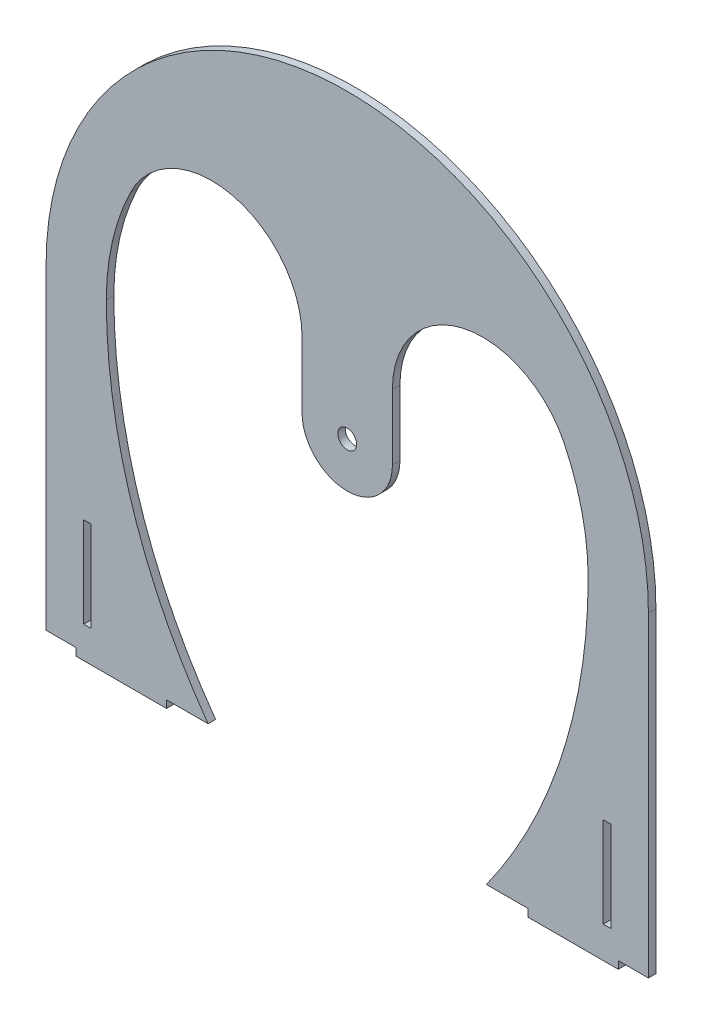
ISO-10303-21;
HEADER;
FILE_DESCRIPTION(('STEP AP214'),'2;1');
FILE_NAME('part.step','',(''),(''),'','','');
FILE_SCHEMA(('AUTOMOTIVE_DESIGN { 1 0 10303 214 1 1 1 1 }'));
ENDSEC;
DATA;
#1=APPLICATION_CONTEXT('core data for automotive mechanical design processes');
#2=APPLICATION_PROTOCOL_DEFINITION('international standard','automotive_design',2000,#1);
#3=PRODUCT_CONTEXT('',#1,'mechanical');
#4=PRODUCT('Part','Part','',(#3));
#5=PRODUCT_RELATED_PRODUCT_CATEGORY('part','',(#4));
#6=PRODUCT_DEFINITION_FORMATION('','',#4);
#7=PRODUCT_DEFINITION_CONTEXT('part definition',#1,'design');
#8=PRODUCT_DEFINITION('design','',#6,#7);
#9=PRODUCT_DEFINITION_SHAPE('','',#8);
#10=(LENGTH_UNIT() NAMED_UNIT(*) SI_UNIT(.MILLI.,.METRE.));
#11=(NAMED_UNIT(*) PLANE_ANGLE_UNIT() SI_UNIT($,.RADIAN.));
#12=(NAMED_UNIT(*) SI_UNIT($,.STERADIAN.) SOLID_ANGLE_UNIT());
#13=UNCERTAINTY_MEASURE_WITH_UNIT(LENGTH_MEASURE(1.E-05),#10,'distance_accuracy_value','');
#14=(GEOMETRIC_REPRESENTATION_CONTEXT(3) GLOBAL_UNCERTAINTY_ASSIGNED_CONTEXT((#13)) GLOBAL_UNIT_ASSIGNED_CONTEXT((#10,
#11,#12)) REPRESENTATION_CONTEXT('',''));
#15=CARTESIAN_POINT('',(0.,0.,0.));
#16=DIRECTION('',(0.,0.,1.));
#17=DIRECTION('',(1.,0.,0.));
#18=AXIS2_PLACEMENT_3D('',#15,#16,#17);
#19=CARTESIAN_POINT('',(0.,-133.35,3.175));
#20=DIRECTION('',(0.,1.,0.));
#21=DIRECTION('',(0.,0.,1.));
#22=AXIS2_PLACEMENT_3D('',#19,#20,#21);
#23=PLANE('',#22);
#24=DIRECTION('',(0.,0.,-1.));
#25=VECTOR('',#24,1.);
#26=CARTESIAN_POINT('',(76.2,-133.35,3.175));
#27=LINE('',#26,#25);
#28=CARTESIAN_POINT('',(76.2,-133.35,3.175));
#29=VERTEX_POINT('',#28);
#30=CARTESIAN_POINT('',(76.2,-133.35,0.));
#31=VERTEX_POINT('',#30);
#32=EDGE_CURVE('E57',#29,#31,#27,.T.);
#33=ORIENTED_EDGE('',*,*,#32,.F.);
#34=DIRECTION('',(1.,0.,0.));
#35=VECTOR('',#34,1.);
#36=CARTESIAN_POINT('',(0.,-133.35,3.175));
#37=LINE('',#36,#35);
#38=CARTESIAN_POINT('',(58.6764322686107,-133.35,3.175));
#39=VERTEX_POINT('',#38);
#40=EDGE_CURVE('E309',#39,#29,#37,.T.);
#41=ORIENTED_EDGE('',*,*,#40,.F.);
#42=DIRECTION('',(0.,0.,-1.));
#43=VECTOR('',#42,1.);
#44=CARTESIAN_POINT('',(58.6764322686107,-133.35,3.175));
#45=LINE('',#44,#43);
#46=CARTESIAN_POINT('',(58.6764322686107,-133.35,0.));
#47=VERTEX_POINT('',#46);
#48=EDGE_CURVE('E436',#39,#47,#45,.T.);
#49=ORIENTED_EDGE('',*,*,#48,.T.);
#50=DIRECTION('',(1.,0.,0.));
#51=VECTOR('',#50,1.);
#52=CARTESIAN_POINT('',(0.,-133.35,0.));
#53=LINE('',#52,#51);
#54=EDGE_CURVE('E365',#47,#31,#53,.T.);
#55=ORIENTED_EDGE('',*,*,#54,.T.);
#56=EDGE_LOOP('',(#33,#41,#49,#55));
#57=FACE_BOUND('',#56,.T.);
#58=ADVANCED_FACE('F34',(#57),#23,.F.);
#59=DIRECTION('',(0.,0.,1.));
#60=VECTOR('',#59,1.);
#61=CARTESIAN_POINT('',(114.3,-133.35,3.175));
#62=LINE('',#61,#60);
#63=CARTESIAN_POINT('',(114.3,-133.35,0.));
#64=VERTEX_POINT('',#63);
#65=CARTESIAN_POINT('',(114.3,-133.35,3.175));
#66=VERTEX_POINT('',#65);
#67=EDGE_CURVE('E254',#64,#66,#62,.T.);
#68=ORIENTED_EDGE('',*,*,#67,.F.);
#69=CARTESIAN_POINT('',(127.,-133.35,0.));
#70=VERTEX_POINT('',#69);
#71=EDGE_CURVE('E364',#64,#70,#53,.T.);
#72=ORIENTED_EDGE('',*,*,#71,.T.);
#73=DIRECTION('',(0.,0.,-1.));
#74=VECTOR('',#73,1.);
#75=CARTESIAN_POINT('',(127.,-133.35,3.175));
#76=LINE('',#75,#74);
#77=CARTESIAN_POINT('',(127.,-133.35,3.175));
#78=VERTEX_POINT('',#77);
#79=EDGE_CURVE('E433',#78,#70,#76,.T.);
#80=ORIENTED_EDGE('',*,*,#79,.F.);
#81=EDGE_CURVE('E49',#66,#78,#37,.T.);
#82=ORIENTED_EDGE('',*,*,#81,.F.);
#83=EDGE_LOOP('',(#68,#72,#80,#82));
#84=FACE_BOUND('',#83,.T.);
#85=ADVANCED_FACE('F512',(#84),#23,.F.);
#86=CARTESIAN_POINT('',(0.,-133.35,3.175));
#87=DIRECTION('',(0.,1.,0.));
#88=DIRECTION('',(0.,0.,1.));
#89=AXIS2_PLACEMENT_3D('',#86,#87,#88);
#90=PLANE('',#89);
#91=DIRECTION('',(0.,0.,-1.));
#92=VECTOR('',#91,1.);
#93=CARTESIAN_POINT('',(-114.3,-133.35,3.175));
#94=LINE('',#93,#92);
#95=CARTESIAN_POINT('',(-114.3,-133.35,3.175));
#96=VERTEX_POINT('',#95);
#97=CARTESIAN_POINT('',(-114.3,-133.35,0.));
#98=VERTEX_POINT('',#97);
#99=EDGE_CURVE('E257',#96,#98,#94,.T.);
#100=ORIENTED_EDGE('',*,*,#99,.F.);
#101=DIRECTION('',(1.,0.,0.));
#102=VECTOR('',#101,1.);
#103=CARTESIAN_POINT('',(0.,-133.35,3.175));
#104=LINE('',#103,#102);
#105=CARTESIAN_POINT('',(-127.,-133.35,3.175));
#106=VERTEX_POINT('',#105);
#107=EDGE_CURVE('E319',#106,#96,#104,.T.);
#108=ORIENTED_EDGE('',*,*,#107,.F.);
#109=DIRECTION('',(0.,0.,-1.));
#110=VECTOR('',#109,1.);
#111=CARTESIAN_POINT('',(-127.,-133.35,3.175));
#112=LINE('',#111,#110);
#113=CARTESIAN_POINT('',(-127.,-133.35,0.));
#114=VERTEX_POINT('',#113);
#115=EDGE_CURVE('E426',#106,#114,#112,.T.);
#116=ORIENTED_EDGE('',*,*,#115,.T.);
#117=DIRECTION('',(1.,0.,0.));
#118=VECTOR('',#117,1.);
#119=CARTESIAN_POINT('',(0.,-133.35,0.));
#120=LINE('',#119,#118);
#121=EDGE_CURVE('E376',#114,#98,#120,.T.);
#122=ORIENTED_EDGE('',*,*,#121,.T.);
#123=EDGE_LOOP('',(#100,#108,#116,#122));
#124=FACE_BOUND('',#123,.T.);
#125=ADVANCED_FACE('F529',(#124),#90,.F.);
#126=DIRECTION('',(0.,0.,1.));
#127=VECTOR('',#126,1.);
#128=CARTESIAN_POINT('',(-76.2,-133.35,3.175));
#129=LINE('',#128,#127);
#130=CARTESIAN_POINT('',(-76.2,-133.35,0.));
#131=VERTEX_POINT('',#130);
#132=CARTESIAN_POINT('',(-76.2,-133.35,3.175));
#133=VERTEX_POINT('',#132);
#134=EDGE_CURVE('E260',#131,#133,#129,.T.);
#135=ORIENTED_EDGE('',*,*,#134,.F.);
#136=CARTESIAN_POINT('',(-58.6764322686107,-133.35,0.));
#137=VERTEX_POINT('',#136);
#138=EDGE_CURVE('E375',#131,#137,#120,.T.);
#139=ORIENTED_EDGE('',*,*,#138,.T.);
#140=DIRECTION('',(0.,0.,-1.));
#141=VECTOR('',#140,1.);
#142=CARTESIAN_POINT('',(-58.6764322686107,-133.35,3.175));
#143=LINE('',#142,#141);
#144=CARTESIAN_POINT('',(-58.6764322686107,-133.35,3.175));
#145=VERTEX_POINT('',#144);
#146=EDGE_CURVE('E347',#145,#137,#143,.T.);
#147=ORIENTED_EDGE('',*,*,#146,.F.);
#148=EDGE_CURVE('E318',#133,#145,#104,.T.);
#149=ORIENTED_EDGE('',*,*,#148,.F.);
#150=EDGE_LOOP('',(#135,#139,#147,#149));
#151=FACE_BOUND('',#150,.T.);
#152=ADVANCED_FACE('F544',(#151),#90,.F.);
#153=CARTESIAN_POINT('',(3.7192471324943E-13,-85.0900000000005,3.175));
#154=DIRECTION('',(0.,1.,0.));
#155=DIRECTION('',(-1.,0.,0.));
#156=AXIS2_PLACEMENT_3D('',#153,#154,#155);
#157=PLANE('',#156);
#158=DIRECTION('',(1.,0.,0.));
#159=VECTOR('',#158,1.);
#160=CARTESIAN_POINT('',(3.7192471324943E-13,-85.0900000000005,0.));
#161=LINE('',#160,#159);
#162=CARTESIAN_POINT('',(107.95,-85.09,0.));
#163=VERTEX_POINT('',#162);
#164=CARTESIAN_POINT('',(111.125,-85.09,0.));
#165=VERTEX_POINT('',#164);
#166=EDGE_CURVE('E393',#163,#165,#161,.T.);
#167=ORIENTED_EDGE('',*,*,#166,.T.);
#168=DIRECTION('',(0.,0.,-1.));
#169=VECTOR('',#168,1.);
#170=CARTESIAN_POINT('',(111.125,-85.09,3.175));
#171=LINE('',#170,#169);
#172=CARTESIAN_POINT('',(111.125,-85.09,3.175));
#173=VERTEX_POINT('',#172);
#174=EDGE_CURVE('E411',#173,#165,#171,.T.);
#175=ORIENTED_EDGE('',*,*,#174,.F.);
#176=DIRECTION('',(1.,0.,0.));
#177=VECTOR('',#176,1.);
#178=CARTESIAN_POINT('',(3.7192471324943E-13,-85.0900000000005,3.175));
#179=LINE('',#178,#177);
#180=CARTESIAN_POINT('',(107.95,-85.09,3.175));
#181=VERTEX_POINT('',#180);
#182=EDGE_CURVE('E336',#181,#173,#179,.T.);
#183=ORIENTED_EDGE('',*,*,#182,.F.);
#184=DIRECTION('',(0.,0.,-1.));
#185=VECTOR('',#184,1.);
#186=CARTESIAN_POINT('',(107.95,-85.09,3.175));
#187=LINE('',#186,#185);
#188=EDGE_CURVE('E404',#181,#163,#187,.T.);
#189=ORIENTED_EDGE('',*,*,#188,.T.);
#190=EDGE_LOOP('',(#167,#175,#183,#189));
#191=FACE_BOUND('',#190,.T.);
#192=ADVANCED_FACE('F749',(#191),#157,.F.);
#193=CARTESIAN_POINT('',(111.125,0.,3.175));
#194=DIRECTION('',(1.,0.,0.));
#195=DIRECTION('',(0.,0.,-1.));
#196=AXIS2_PLACEMENT_3D('',#193,#194,#195);
#197=PLANE('',#196);
#198=DIRECTION('',(0.,-1.,0.));
#199=VECTOR('',#198,1.);
#200=CARTESIAN_POINT('',(111.125,0.,0.));
#201=LINE('',#200,#199);
#202=CARTESIAN_POINT('',(111.125,-123.19,0.));
#203=VERTEX_POINT('',#202);
#204=EDGE_CURVE('E396',#165,#203,#201,.T.);
#205=ORIENTED_EDGE('',*,*,#204,.T.);
#206=DIRECTION('',(0.,0.,-1.));
#207=VECTOR('',#206,1.);
#208=CARTESIAN_POINT('',(111.125,-123.19,3.175));
#209=LINE('',#208,#207);
#210=CARTESIAN_POINT('',(111.125,-123.19,3.175));
#211=VERTEX_POINT('',#210);
#212=EDGE_CURVE('E409',#211,#203,#209,.T.);
#213=ORIENTED_EDGE('',*,*,#212,.F.);
#214=DIRECTION('',(0.,-1.,0.));
#215=VECTOR('',#214,1.);
#216=CARTESIAN_POINT('',(111.125,0.,3.175));
#217=LINE('',#216,#215);
#218=EDGE_CURVE('E339',#173,#211,#217,.T.);
#219=ORIENTED_EDGE('',*,*,#218,.F.);
#220=ORIENTED_EDGE('',*,*,#174,.T.);
#221=EDGE_LOOP('',(#205,#213,#219,#220));
#222=FACE_BOUND('',#221,.T.);
#223=ADVANCED_FACE('F761',(#222),#197,.F.);
#224=CARTESIAN_POINT('',(0.,-123.19,3.175));
#225=DIRECTION('',(0.,1.,0.));
#226=DIRECTION('',(0.,0.,1.));
#227=AXIS2_PLACEMENT_3D('',#224,#225,#226);
#228=PLANE('',#227);
#229=DIRECTION('',(1.,0.,0.));
#230=VECTOR('',#229,1.);
#231=CARTESIAN_POINT('',(0.,-123.19,0.));
#232=LINE('',#231,#230);
#233=CARTESIAN_POINT('',(107.95,-123.19,0.));
#234=VERTEX_POINT('',#233);
#235=EDGE_CURVE('E399',#234,#203,#232,.T.);
#236=ORIENTED_EDGE('',*,*,#235,.F.);
#237=DIRECTION('',(0.,0.,-1.));
#238=VECTOR('',#237,1.);
#239=CARTESIAN_POINT('',(107.95,-123.19,3.175));
#240=LINE('',#239,#238);
#241=CARTESIAN_POINT('',(107.95,-123.19,3.175));
#242=VERTEX_POINT('',#241);
#243=EDGE_CURVE('E406',#242,#234,#240,.T.);
#244=ORIENTED_EDGE('',*,*,#243,.F.);
#245=DIRECTION('',(1.,0.,0.));
#246=VECTOR('',#245,1.);
#247=CARTESIAN_POINT('',(0.,-123.19,3.175));
#248=LINE('',#247,#246);
#249=EDGE_CURVE('E341',#242,#211,#248,.T.);
#250=ORIENTED_EDGE('',*,*,#249,.T.);
#251=ORIENTED_EDGE('',*,*,#212,.T.);
#252=EDGE_LOOP('',(#236,#244,#250,#251));
#253=FACE_BOUND('',#252,.T.);
#254=ADVANCED_FACE('F769',(#253),#228,.T.);
#255=CARTESIAN_POINT('',(-111.125,0.,3.175));
#256=DIRECTION('',(1.,0.,0.));
#257=DIRECTION('',(0.,0.,-1.));
#258=AXIS2_PLACEMENT_3D('',#255,#256,#257);
#259=PLANE('',#258);
#260=DIRECTION('',(0.,-1.,0.));
#261=VECTOR('',#260,1.);
#262=CARTESIAN_POINT('',(-111.125,0.,0.));
#263=LINE('',#262,#261);
#264=CARTESIAN_POINT('',(-111.125,-85.09,0.));
#265=VERTEX_POINT('',#264);
#266=CARTESIAN_POINT('',(-111.125,-123.19,0.));
#267=VERTEX_POINT('',#266);
#268=EDGE_CURVE('E378',#265,#267,#263,.T.);
#269=ORIENTED_EDGE('',*,*,#268,.F.);
#270=DIRECTION('',(0.,0.,-1.));
#271=VECTOR('',#270,1.);
#272=CARTESIAN_POINT('',(-111.125,-85.09,3.175));
#273=LINE('',#272,#271);
#274=CARTESIAN_POINT('',(-111.125,-85.09,3.175));
#275=VERTEX_POINT('',#274);
#276=EDGE_CURVE('E407',#275,#265,#273,.T.);
#277=ORIENTED_EDGE('',*,*,#276,.F.);
#278=DIRECTION('',(0.,-1.,0.));
#279=VECTOR('',#278,1.);
#280=CARTESIAN_POINT('',(-111.125,0.,3.175));
#281=LINE('',#280,#279);
#282=CARTESIAN_POINT('',(-111.125,-123.19,3.175));
#283=VERTEX_POINT('',#282);
#284=EDGE_CURVE('E322',#275,#283,#281,.T.);
#285=ORIENTED_EDGE('',*,*,#284,.T.);
#286=DIRECTION('',(0.,0.,-1.));
#287=VECTOR('',#286,1.);
#288=CARTESIAN_POINT('',(-111.125,-123.19,3.175));
#289=LINE('',#288,#287);
#290=EDGE_CURVE('E415',#283,#267,#289,.T.);
#291=ORIENTED_EDGE('',*,*,#290,.T.);
#292=EDGE_LOOP('',(#269,#277,#285,#291));
#293=FACE_BOUND('',#292,.T.);
#294=ADVANCED_FACE('F777',(#293),#259,.T.);
#295=CARTESIAN_POINT('',(-3.7192471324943E-13,-85.0900000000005,3.175));
#296=DIRECTION('',(0.,-1.,0.));
#297=DIRECTION('',(1.,0.,0.));
#298=AXIS2_PLACEMENT_3D('',#295,#296,#297);
#299=PLANE('',#298);
#300=DIRECTION('',(-1.,0.,0.));
#301=VECTOR('',#300,1.);
#302=CARTESIAN_POINT('',(-3.7192471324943E-13,-85.0900000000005,0.));
#303=LINE('',#302,#301);
#304=CARTESIAN_POINT('',(-107.95,-85.09,0.));
#305=VERTEX_POINT('',#304);
#306=EDGE_CURVE('E381',#305,#265,#303,.T.);
#307=ORIENTED_EDGE('',*,*,#306,.F.);
#308=DIRECTION('',(0.,0.,-1.));
#309=VECTOR('',#308,1.);
#310=CARTESIAN_POINT('',(-107.95,-85.09,3.175));
#311=LINE('',#310,#309);
#312=CARTESIAN_POINT('',(-107.95,-85.09,3.175));
#313=VERTEX_POINT('',#312);
#314=EDGE_CURVE('E421',#313,#305,#311,.T.);
#315=ORIENTED_EDGE('',*,*,#314,.F.);
#316=DIRECTION('',(-1.,0.,0.));
#317=VECTOR('',#316,1.);
#318=CARTESIAN_POINT('',(-3.7192471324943E-13,-85.0900000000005,3.175));
#319=LINE('',#318,#317);
#320=EDGE_CURVE('E325',#313,#275,#319,.T.);
#321=ORIENTED_EDGE('',*,*,#320,.T.);
#322=ORIENTED_EDGE('',*,*,#276,.T.);
#323=EDGE_LOOP('',(#307,#315,#321,#322));
#324=FACE_BOUND('',#323,.T.);
#325=ADVANCED_FACE('F556',(#324),#299,.T.);
#326=CARTESIAN_POINT('',(-107.95,0.,3.175));
#327=DIRECTION('',(1.,0.,0.));
#328=DIRECTION('',(0.,0.,-1.));
#329=AXIS2_PLACEMENT_3D('',#326,#327,#328);
#330=PLANE('',#329);
#331=DIRECTION('',(0.,-1.,0.));
#332=VECTOR('',#331,1.);
#333=CARTESIAN_POINT('',(-107.95,0.,0.));
#334=LINE('',#333,#332);
#335=CARTESIAN_POINT('',(-107.95,-123.19,0.));
#336=VERTEX_POINT('',#335);
#337=EDGE_CURVE('E384',#305,#336,#334,.T.);
#338=ORIENTED_EDGE('',*,*,#337,.T.);
#339=DIRECTION('',(0.,0.,-1.));
#340=VECTOR('',#339,1.);
#341=CARTESIAN_POINT('',(-107.95,-123.19,3.175));
#342=LINE('',#341,#340);
#343=CARTESIAN_POINT('',(-107.95,-123.19,3.175));
#344=VERTEX_POINT('',#343);
#345=EDGE_CURVE('E417',#344,#336,#342,.T.);
#346=ORIENTED_EDGE('',*,*,#345,.F.);
#347=DIRECTION('',(0.,-1.,0.));
#348=VECTOR('',#347,1.);
#349=CARTESIAN_POINT('',(-107.95,0.,3.175));
#350=LINE('',#349,#348);
#351=EDGE_CURVE('E328',#313,#344,#350,.T.);
#352=ORIENTED_EDGE('',*,*,#351,.F.);
#353=ORIENTED_EDGE('',*,*,#314,.T.);
#354=EDGE_LOOP('',(#338,#346,#352,#353));
#355=FACE_BOUND('',#354,.T.);
#356=ADVANCED_FACE('F549',(#355),#330,.F.);
#357=CARTESIAN_POINT('',(127.,0.,3.175));
#358=DIRECTION('',(0.,0.,-1.));
#359=DIRECTION('',(-1.,0.,0.));
#360=AXIS2_PLACEMENT_3D('',#357,#358,#359);
#361=CYLINDRICAL_SURFACE('',#360,228.6);
#362=CARTESIAN_POINT('',(127.,0.,0.));
#363=DIRECTION('',(0.,0.,1.));
#364=DIRECTION('',(1.,0.,0.));
#365=AXIS2_PLACEMENT_3D('',#362,#363,#364);
#366=CIRCLE('',#365,228.6);
#367=CARTESIAN_POINT('',(-101.6,0.,0.));
#368=VERTEX_POINT('',#367);
#369=EDGE_CURVE('E289',#368,#137,#366,.T.);
#370=ORIENTED_EDGE('',*,*,#369,.F.);
#371=DIRECTION('',(0.,0.,-1.));
#372=VECTOR('',#371,1.);
#373=CARTESIAN_POINT('',(-101.6,0.,3.175));
#374=LINE('',#373,#372);
#375=CARTESIAN_POINT('',(-101.6,0.,3.175));
#376=VERTEX_POINT('',#375);
#377=EDGE_CURVE('E418',#376,#368,#374,.T.);
#378=ORIENTED_EDGE('',*,*,#377,.F.);
#379=CARTESIAN_POINT('',(127.,0.,3.175));
#380=DIRECTION('',(0.,0.,1.));
#381=DIRECTION('',(1.,0.,0.));
#382=AXIS2_PLACEMENT_3D('',#379,#380,#381);
#383=CIRCLE('',#382,228.6);
#384=EDGE_CURVE('E290',#376,#145,#383,.T.);
#385=ORIENTED_EDGE('',*,*,#384,.T.);
#386=ORIENTED_EDGE('',*,*,#146,.T.);
#387=EDGE_LOOP('',(#370,#378,#385,#386));
#388=FACE_BOUND('',#387,.T.);
#389=ADVANCED_FACE('F547',(#388),#361,.F.);
#390=CARTESIAN_POINT('',(0.,0.,3.175));
#391=DIRECTION('',(0.,0.,-1.));
#392=DIRECTION('',(-1.,0.,0.));
#393=AXIS2_PLACEMENT_3D('',#390,#391,#392);
#394=CYLINDRICAL_SURFACE('',#393,101.6);
#395=CARTESIAN_POINT('',(0.,0.,0.));
#396=DIRECTION('',(0.,0.,1.));
#397=DIRECTION('',(1.,0.,0.));
#398=AXIS2_PLACEMENT_3D('',#395,#396,#397);
#399=CIRCLE('',#398,101.6);
#400=CARTESIAN_POINT('',(-91.44,44.2864132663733,0.));
#401=VERTEX_POINT('',#400);
#402=EDGE_CURVE('E349',#401,#368,#399,.T.);
#403=ORIENTED_EDGE('',*,*,#402,.F.);
#404=DIRECTION('',(0.,0.,-1.));
#405=VECTOR('',#404,1.);
#406=CARTESIAN_POINT('',(-91.44,44.2864132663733,3.175));
#407=LINE('',#406,#405);
#408=CARTESIAN_POINT('',(-91.44,44.2864132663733,3.175));
#409=VERTEX_POINT('',#408);
#410=EDGE_CURVE('E455',#401,#409,#407,.F.);
#411=ORIENTED_EDGE('',*,*,#410,.T.);
#412=CARTESIAN_POINT('',(0.,0.,3.175));
#413=DIRECTION('',(0.,0.,1.));
#414=DIRECTION('',(1.,0.,0.));
#415=AXIS2_PLACEMENT_3D('',#412,#413,#414);
#416=CIRCLE('',#415,101.6);
#417=EDGE_CURVE('E293',#409,#376,#416,.T.);
#418=ORIENTED_EDGE('',*,*,#417,.T.);
#419=ORIENTED_EDGE('',*,*,#377,.T.);
#420=EDGE_LOOP('',(#403,#411,#418,#419));
#421=FACE_BOUND('',#420,.T.);
#422=ADVANCED_FACE('F467',(#421),#394,.F.);
#423=CARTESIAN_POINT('',(-19.05,0.,3.175));
#424=DIRECTION('',(-1.,0.,0.));
#425=DIRECTION('',(0.,0.,1.));
#426=AXIS2_PLACEMENT_3D('',#423,#424,#425);
#427=PLANE('',#426);
#428=DIRECTION('',(0.,1.,0.));
#429=VECTOR('',#428,1.);
#430=CARTESIAN_POINT('',(-19.05,0.,3.175));
#431=LINE('',#430,#429);
#432=CARTESIAN_POINT('',(-19.05,0.,3.175));
#433=VERTEX_POINT('',#432);
#434=CARTESIAN_POINT('',(-19.05,27.6790082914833,3.175));
#435=VERTEX_POINT('',#434);
#436=EDGE_CURVE('E296',#433,#435,#431,.T.);
#437=ORIENTED_EDGE('',*,*,#436,.T.);
#438=DIRECTION('',(0.,0.,1.));
#439=VECTOR('',#438,1.);
#440=CARTESIAN_POINT('',(-19.05,27.6790082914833,0.));
#441=LINE('',#440,#439);
#442=CARTESIAN_POINT('',(-19.05,27.6790082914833,0.));
#443=VERTEX_POINT('',#442);
#444=EDGE_CURVE('E452',#435,#443,#441,.F.);
#445=ORIENTED_EDGE('',*,*,#444,.T.);
#446=DIRECTION('',(0.,1.,0.));
#447=VECTOR('',#446,1.);
#448=CARTESIAN_POINT('',(-19.05,0.,0.));
#449=LINE('',#448,#447);
#450=CARTESIAN_POINT('',(-19.05,0.,0.));
#451=VERTEX_POINT('',#450);
#452=EDGE_CURVE('E351',#451,#443,#449,.T.);
#453=ORIENTED_EDGE('',*,*,#452,.F.);
#454=DIRECTION('',(0.,0.,-1.));
#455=VECTOR('',#454,1.);
#456=CARTESIAN_POINT('',(-19.05,0.,3.175));
#457=LINE('',#456,#455);
#458=EDGE_CURVE('E444',#433,#451,#457,.T.);
#459=ORIENTED_EDGE('',*,*,#458,.F.);
#460=EDGE_LOOP('',(#437,#445,#453,#459));
#461=FACE_BOUND('',#460,.T.);
#462=ADVANCED_FACE('F478',(#461),#427,.T.);
#463=CARTESIAN_POINT('',(0.,0.,3.175));
#464=DIRECTION('',(0.,0.,-1.));
#465=DIRECTION('',(-1.,0.,0.));
#466=AXIS2_PLACEMENT_3D('',#463,#464,#465);
#467=CYLINDRICAL_SURFACE('',#466,19.05);
#468=CARTESIAN_POINT('',(0.,0.,0.));
#469=DIRECTION('',(0.,0.,1.));
#470=DIRECTION('',(1.,0.,0.));
#471=AXIS2_PLACEMENT_3D('',#468,#469,#470);
#472=CIRCLE('',#471,19.05);
#473=CARTESIAN_POINT('',(19.05,0.,0.));
#474=VERTEX_POINT('',#473);
#475=EDGE_CURVE('E354',#451,#474,#472,.T.);
#476=ORIENTED_EDGE('',*,*,#475,.T.);
#477=DIRECTION('',(0.,0.,-1.));
#478=VECTOR('',#477,1.);
#479=CARTESIAN_POINT('',(19.05,0.,3.175));
#480=LINE('',#479,#478);
#481=CARTESIAN_POINT('',(19.05,0.,3.175));
#482=VERTEX_POINT('',#481);
#483=EDGE_CURVE('E441',#482,#474,#480,.T.);
#484=ORIENTED_EDGE('',*,*,#483,.F.);
#485=CARTESIAN_POINT('',(0.,0.,3.175));
#486=DIRECTION('',(0.,0.,1.));
#487=DIRECTION('',(1.,0.,0.));
#488=AXIS2_PLACEMENT_3D('',#485,#486,#487);
#489=CIRCLE('',#488,19.05);
#490=EDGE_CURVE('E299',#433,#482,#489,.T.);
#491=ORIENTED_EDGE('',*,*,#490,.F.);
#492=ORIENTED_EDGE('',*,*,#458,.T.);
#493=EDGE_LOOP('',(#476,#484,#491,#492));
#494=FACE_BOUND('',#493,.T.);
#495=ADVANCED_FACE('F482',(#494),#467,.T.);
#496=CARTESIAN_POINT('',(19.05,0.,3.175));
#497=DIRECTION('',(-1.,0.,0.));
#498=DIRECTION('',(0.,0.,1.));
#499=AXIS2_PLACEMENT_3D('',#496,#497,#498);
#500=PLANE('',#499);
#501=DIRECTION('',(0.,1.,0.));
#502=VECTOR('',#501,1.);
#503=CARTESIAN_POINT('',(19.05,0.,0.));
#504=LINE('',#503,#502);
#505=CARTESIAN_POINT('',(19.05,27.6790082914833,0.));
#506=VERTEX_POINT('',#505);
#507=EDGE_CURVE('E356',#474,#506,#504,.T.);
#508=ORIENTED_EDGE('',*,*,#507,.T.);
#509=DIRECTION('',(0.,0.,-1.));
#510=VECTOR('',#509,1.);
#511=CARTESIAN_POINT('',(19.05,27.6790082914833,3.175));
#512=LINE('',#511,#510);
#513=CARTESIAN_POINT('',(19.05,27.6790082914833,3.175));
#514=VERTEX_POINT('',#513);
#515=EDGE_CURVE('E450',#506,#514,#512,.F.);
#516=ORIENTED_EDGE('',*,*,#515,.T.);
#517=DIRECTION('',(0.,1.,0.));
#518=VECTOR('',#517,1.);
#519=CARTESIAN_POINT('',(19.05,0.,3.175));
#520=LINE('',#519,#518);
#521=EDGE_CURVE('E301',#482,#514,#520,.T.);
#522=ORIENTED_EDGE('',*,*,#521,.F.);
#523=ORIENTED_EDGE('',*,*,#483,.T.);
#524=EDGE_LOOP('',(#508,#516,#522,#523));
#525=FACE_BOUND('',#524,.T.);
#526=ADVANCED_FACE('F571',(#525),#500,.F.);
#527=CARTESIAN_POINT('',(0.,0.,3.175));
#528=DIRECTION('',(0.,0.,-1.));
#529=DIRECTION('',(-1.,0.,0.));
#530=AXIS2_PLACEMENT_3D('',#527,#528,#529);
#531=CYLINDRICAL_SURFACE('',#530,101.6);
#532=CARTESIAN_POINT('',(0.,0.,3.175));
#533=DIRECTION('',(0.,0.,1.));
#534=DIRECTION('',(1.,0.,0.));
#535=AXIS2_PLACEMENT_3D('',#532,#533,#534);
#536=CIRCLE('',#535,101.6);
#537=CARTESIAN_POINT('',(101.6,0.,3.175));
#538=VERTEX_POINT('',#537);
#539=CARTESIAN_POINT('',(91.44,44.2864132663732,3.175));
#540=VERTEX_POINT('',#539);
#541=EDGE_CURVE('E304',#538,#540,#536,.T.);
#542=ORIENTED_EDGE('',*,*,#541,.T.);
#543=DIRECTION('',(0.,0.,-1.));
#544=VECTOR('',#543,1.);
#545=CARTESIAN_POINT('',(91.44,44.2864132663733,3.175));
#546=LINE('',#545,#544);
#547=CARTESIAN_POINT('',(91.44,44.2864132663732,0.));
#548=VERTEX_POINT('',#547);
#549=EDGE_CURVE('E414',#540,#548,#546,.T.);
#550=ORIENTED_EDGE('',*,*,#549,.T.);
#551=CARTESIAN_POINT('',(0.,0.,0.));
#552=DIRECTION('',(0.,0.,1.));
#553=DIRECTION('',(1.,0.,0.));
#554=AXIS2_PLACEMENT_3D('',#551,#552,#553);
#555=CIRCLE('',#554,101.6);
#556=CARTESIAN_POINT('',(101.6,0.,0.));
#557=VERTEX_POINT('',#556);
#558=EDGE_CURVE('E359',#557,#548,#555,.T.);
#559=ORIENTED_EDGE('',*,*,#558,.F.);
#560=DIRECTION('',(0.,0.,-1.));
#561=VECTOR('',#560,1.);
#562=CARTESIAN_POINT('',(101.6,0.,3.175));
#563=LINE('',#562,#561);
#564=EDGE_CURVE('E439',#538,#557,#563,.T.);
#565=ORIENTED_EDGE('',*,*,#564,.F.);
#566=EDGE_LOOP('',(#542,#550,#559,#565));
#567=FACE_BOUND('',#566,.T.);
#568=ADVANCED_FACE('F493',(#567),#531,.F.);
#569=CARTESIAN_POINT('',(-127.,0.,3.175));
#570=DIRECTION('',(0.,0.,-1.));
#571=DIRECTION('',(-1.,0.,0.));
#572=AXIS2_PLACEMENT_3D('',#569,#570,#571);
#573=CYLINDRICAL_SURFACE('',#572,228.6);
#574=CARTESIAN_POINT('',(-127.,0.,0.));
#575=DIRECTION('',(0.,0.,1.));
#576=DIRECTION('',(1.,0.,0.));
#577=AXIS2_PLACEMENT_3D('',#574,#575,#576);
#578=CIRCLE('',#577,228.6);
#579=EDGE_CURVE('E362',#557,#47,#578,.F.);
#580=ORIENTED_EDGE('',*,*,#579,.T.);
#581=ORIENTED_EDGE('',*,*,#48,.F.);
#582=CARTESIAN_POINT('',(-127.,0.,3.175));
#583=DIRECTION('',(0.,0.,1.));
#584=DIRECTION('',(1.,0.,0.));
#585=AXIS2_PLACEMENT_3D('',#582,#583,#584);
#586=CIRCLE('',#585,228.6);
#587=EDGE_CURVE('E307',#538,#39,#586,.F.);
#588=ORIENTED_EDGE('',*,*,#587,.F.);
#589=ORIENTED_EDGE('',*,*,#564,.T.);
#590=EDGE_LOOP('',(#580,#581,#588,#589));
#591=FACE_BOUND('',#590,.T.);
#592=ADVANCED_FACE('F498',(#591),#573,.F.);
#593=CARTESIAN_POINT('',(127.,0.,3.175));
#594=DIRECTION('',(-1.,0.,0.));
#595=DIRECTION('',(0.,0.,1.));
#596=AXIS2_PLACEMENT_3D('',#593,#594,#595);
#597=PLANE('',#596);
#598=DIRECTION('',(0.,1.,0.));
#599=VECTOR('',#598,1.);
#600=CARTESIAN_POINT('',(127.,0.,0.));
#601=LINE('',#600,#599);
#602=CARTESIAN_POINT('',(127.,0.,0.));
#603=VERTEX_POINT('',#602);
#604=EDGE_CURVE('E367',#70,#603,#601,.T.);
#605=ORIENTED_EDGE('',*,*,#604,.T.);
#606=DIRECTION('',(0.,0.,-1.));
#607=VECTOR('',#606,1.);
#608=CARTESIAN_POINT('',(127.,0.,3.175));
#609=LINE('',#608,#607);
#610=CARTESIAN_POINT('',(127.,0.,3.175));
#611=VERTEX_POINT('',#610);
#612=EDGE_CURVE('E430',#611,#603,#609,.T.);
#613=ORIENTED_EDGE('',*,*,#612,.F.);
#614=DIRECTION('',(0.,1.,0.));
#615=VECTOR('',#614,1.);
#616=CARTESIAN_POINT('',(127.,0.,3.175));
#617=LINE('',#616,#615);
#618=EDGE_CURVE('E311',#78,#611,#617,.T.);
#619=ORIENTED_EDGE('',*,*,#618,.F.);
#620=ORIENTED_EDGE('',*,*,#79,.T.);
#621=EDGE_LOOP('',(#605,#613,#619,#620));
#622=FACE_BOUND('',#621,.T.);
#623=ADVANCED_FACE('F515',(#622),#597,.F.);
#624=CARTESIAN_POINT('',(0.,0.,3.175));
#625=DIRECTION('',(0.,0.,-1.));
#626=DIRECTION('',(-1.,0.,0.));
#627=AXIS2_PLACEMENT_3D('',#624,#625,#626);
#628=CYLINDRICAL_SURFACE('',#627,127.);
#629=CARTESIAN_POINT('',(0.,0.,0.));
#630=DIRECTION('',(0.,0.,1.));
#631=DIRECTION('',(1.,0.,0.));
#632=AXIS2_PLACEMENT_3D('',#629,#630,#631);
#633=CIRCLE('',#632,127.);
#634=CARTESIAN_POINT('',(-127.,0.,0.));
#635=VERTEX_POINT('',#634);
#636=EDGE_CURVE('E369',#603,#635,#633,.T.);
#637=ORIENTED_EDGE('',*,*,#636,.T.);
#638=DIRECTION('',(0.,0.,-1.));
#639=VECTOR('',#638,1.);
#640=CARTESIAN_POINT('',(-127.,0.,3.175));
#641=LINE('',#640,#639);
#642=CARTESIAN_POINT('',(-127.,0.,3.175));
#643=VERTEX_POINT('',#642);
#644=EDGE_CURVE('E428',#643,#635,#641,.T.);
#645=ORIENTED_EDGE('',*,*,#644,.F.);
#646=CARTESIAN_POINT('',(0.,0.,3.175));
#647=DIRECTION('',(0.,0.,1.));
#648=DIRECTION('',(1.,0.,0.));
#649=AXIS2_PLACEMENT_3D('',#646,#647,#648);
#650=CIRCLE('',#649,127.);
#651=EDGE_CURVE('E313',#611,#643,#650,.T.);
#652=ORIENTED_EDGE('',*,*,#651,.F.);
#653=ORIENTED_EDGE('',*,*,#612,.T.);
#654=EDGE_LOOP('',(#637,#645,#652,#653));
#655=FACE_BOUND('',#654,.T.);
#656=ADVANCED_FACE('F520',(#655),#628,.T.);
#657=CARTESIAN_POINT('',(-127.,0.,3.175));
#658=DIRECTION('',(-1.,0.,0.));
#659=DIRECTION('',(0.,0.,1.));
#660=AXIS2_PLACEMENT_3D('',#657,#658,#659);
#661=PLANE('',#660);
#662=DIRECTION('',(0.,1.,0.));
#663=VECTOR('',#662,1.);
#664=CARTESIAN_POINT('',(-127.,0.,0.));
#665=LINE('',#664,#663);
#666=EDGE_CURVE('E372',#114,#635,#665,.T.);
#667=ORIENTED_EDGE('',*,*,#666,.F.);
#668=ORIENTED_EDGE('',*,*,#115,.F.);
#669=DIRECTION('',(0.,1.,0.));
#670=VECTOR('',#669,1.);
#671=CARTESIAN_POINT('',(-127.,0.,3.175));
#672=LINE('',#671,#670);
#673=EDGE_CURVE('E315',#106,#643,#672,.T.);
#674=ORIENTED_EDGE('',*,*,#673,.T.);
#675=ORIENTED_EDGE('',*,*,#644,.T.);
#676=EDGE_LOOP('',(#667,#668,#674,#675));
#677=FACE_BOUND('',#676,.T.);
#678=ADVANCED_FACE('F526',(#677),#661,.T.);
#679=CARTESIAN_POINT('',(0.,0.,3.175));
#680=DIRECTION('',(0.,0.,-1.));
#681=DIRECTION('',(-1.,0.,0.));
#682=AXIS2_PLACEMENT_3D('',#679,#680,#681);
#683=CYLINDRICAL_SURFACE('',#682,3.96875);
#684=CARTESIAN_POINT('',(0.,0.,3.175));
#685=DIRECTION('',(0.,0.,1.));
#686=DIRECTION('',(1.,0.,0.));
#687=AXIS2_PLACEMENT_3D('',#684,#685,#686);
#688=CIRCLE('',#687,3.96875);
#689=CARTESIAN_POINT('',(3.96875,0.,3.175));
#690=VERTEX_POINT('',#689);
#691=EDGE_CURVE('E333',#690,#690,#688,.T.);
#692=ORIENTED_EDGE('',*,*,#691,.T.);
#693=EDGE_LOOP('',(#692));
#694=FACE_BOUND('',#693,.T.);
#695=CARTESIAN_POINT('',(0.,0.,0.));
#696=DIRECTION('',(0.,0.,1.));
#697=DIRECTION('',(1.,0.,0.));
#698=AXIS2_PLACEMENT_3D('',#695,#696,#697);
#699=CIRCLE('',#698,3.96875);
#700=CARTESIAN_POINT('',(3.96875,0.,0.));
#701=VERTEX_POINT('',#700);
#702=EDGE_CURVE('E390',#701,#701,#699,.T.);
#703=ORIENTED_EDGE('',*,*,#702,.F.);
#704=EDGE_LOOP('',(#703));
#705=FACE_BOUND('',#704,.T.);
#706=ADVANCED_FACE('F614',(#694,#705),#683,.F.);
#707=CARTESIAN_POINT('',(0.,-123.19,3.175));
#708=DIRECTION('',(0.,-1.,0.));
#709=DIRECTION('',(0.,0.,-1.));
#710=AXIS2_PLACEMENT_3D('',#707,#708,#709);
#711=PLANE('',#710);
#712=DIRECTION('',(-1.,0.,0.));
#713=VECTOR('',#712,1.);
#714=CARTESIAN_POINT('',(0.,-123.19,0.));
#715=LINE('',#714,#713);
#716=EDGE_CURVE('E387',#336,#267,#715,.T.);
#717=ORIENTED_EDGE('',*,*,#716,.T.);
#718=ORIENTED_EDGE('',*,*,#290,.F.);
#719=DIRECTION('',(-1.,0.,0.));
#720=VECTOR('',#719,1.);
#721=CARTESIAN_POINT('',(0.,-123.19,3.175));
#722=LINE('',#721,#720);
#723=EDGE_CURVE('E331',#344,#283,#722,.T.);
#724=ORIENTED_EDGE('',*,*,#723,.F.);
#725=ORIENTED_EDGE('',*,*,#345,.T.);
#726=EDGE_LOOP('',(#717,#718,#724,#725));
#727=FACE_BOUND('',#726,.T.);
#728=ADVANCED_FACE('F621',(#727),#711,.F.);
#729=CARTESIAN_POINT('',(107.95,0.,3.175));
#730=DIRECTION('',(1.,0.,0.));
#731=DIRECTION('',(0.,0.,-1.));
#732=AXIS2_PLACEMENT_3D('',#729,#730,#731);
#733=PLANE('',#732);
#734=DIRECTION('',(0.,-1.,0.));
#735=VECTOR('',#734,1.);
#736=CARTESIAN_POINT('',(107.95,0.,0.));
#737=LINE('',#736,#735);
#738=EDGE_CURVE('E294',#163,#234,#737,.T.);
#739=ORIENTED_EDGE('',*,*,#738,.F.);
#740=ORIENTED_EDGE('',*,*,#188,.F.);
#741=DIRECTION('',(0.,-1.,0.));
#742=VECTOR('',#741,1.);
#743=CARTESIAN_POINT('',(107.95,0.,3.175));
#744=LINE('',#743,#742);
#745=EDGE_CURVE('E344',#181,#242,#744,.T.);
#746=ORIENTED_EDGE('',*,*,#745,.T.);
#747=ORIENTED_EDGE('',*,*,#243,.T.);
#748=EDGE_LOOP('',(#739,#740,#746,#747));
#749=FACE_BOUND('',#748,.T.);
#750=ADVANCED_FACE('F629',(#749),#733,.T.);
#751=CARTESIAN_POINT('',(0.,0.,3.175));
#752=DIRECTION('',(0.,0.,1.));
#753=DIRECTION('',(1.,0.,0.));
#754=AXIS2_PLACEMENT_3D('',#751,#752,#753);
#755=PLANE('',#754);
#756=ORIENTED_EDGE('',*,*,#384,.F.);
#757=ORIENTED_EDGE('',*,*,#417,.F.);
#758=CARTESIAN_POINT('',(-57.15,27.6790082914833,3.175));
#759=DIRECTION('',(0.,0.,1.));
#760=DIRECTION('',(1.,0.,0.));
#761=AXIS2_PLACEMENT_3D('',#758,#759,#760);
#762=CIRCLE('',#761,38.1);
#763=EDGE_CURVE('E11',#409,#435,#762,.F.);
#764=ORIENTED_EDGE('',*,*,#763,.T.);
#765=ORIENTED_EDGE('',*,*,#436,.F.);
#766=ORIENTED_EDGE('',*,*,#490,.T.);
#767=ORIENTED_EDGE('',*,*,#521,.T.);
#768=CARTESIAN_POINT('',(57.15,27.6790082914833,3.175));
#769=DIRECTION('',(0.,0.,1.));
#770=DIRECTION('',(1.,0.,0.));
#771=AXIS2_PLACEMENT_3D('',#768,#769,#770);
#772=CIRCLE('',#771,38.1);
#773=EDGE_CURVE('E459',#514,#540,#772,.F.);
#774=ORIENTED_EDGE('',*,*,#773,.T.);
#775=ORIENTED_EDGE('',*,*,#541,.F.);
#776=ORIENTED_EDGE('',*,*,#587,.T.);
#777=ORIENTED_EDGE('',*,*,#40,.T.);
#778=DIRECTION('',(0.,1.,0.));
#779=VECTOR('',#778,1.);
#780=CARTESIAN_POINT('',(76.2,-136.525,3.175));
#781=LINE('',#780,#779);
#782=CARTESIAN_POINT('',(76.2,-136.525,3.175));
#783=VERTEX_POINT('',#782);
#784=EDGE_CURVE('E500',#783,#29,#781,.T.);
#785=ORIENTED_EDGE('',*,*,#784,.F.);
#786=DIRECTION('',(-1.,0.,0.));
#787=VECTOR('',#786,1.);
#788=CARTESIAN_POINT('',(76.2,-136.525,3.175));
#789=LINE('',#788,#787);
#790=CARTESIAN_POINT('',(114.3,-136.525,3.175));
#791=VERTEX_POINT('',#790);
#792=EDGE_CURVE('E250',#791,#783,#789,.T.);
#793=ORIENTED_EDGE('',*,*,#792,.F.);
#794=DIRECTION('',(0.,1.,0.));
#795=VECTOR('',#794,1.);
#796=CARTESIAN_POINT('',(114.3,-136.525,3.175));
#797=LINE('',#796,#795);
#798=EDGE_CURVE('E262',#791,#66,#797,.T.);
#799=ORIENTED_EDGE('',*,*,#798,.T.);
#800=ORIENTED_EDGE('',*,*,#81,.T.);
#801=ORIENTED_EDGE('',*,*,#618,.T.);
#802=ORIENTED_EDGE('',*,*,#651,.T.);
#803=ORIENTED_EDGE('',*,*,#673,.F.);
#804=ORIENTED_EDGE('',*,*,#107,.T.);
#805=DIRECTION('',(0.,1.,0.));
#806=VECTOR('',#805,1.);
#807=CARTESIAN_POINT('',(-114.3,-136.525,3.175));
#808=LINE('',#807,#806);
#809=CARTESIAN_POINT('',(-114.3,-136.525,3.175));
#810=VERTEX_POINT('',#809);
#811=EDGE_CURVE('E274',#810,#96,#808,.T.);
#812=ORIENTED_EDGE('',*,*,#811,.F.);
#813=DIRECTION('',(-1.,0.,0.));
#814=VECTOR('',#813,1.);
#815=CARTESIAN_POINT('',(-114.3,-136.525,3.175));
#816=LINE('',#815,#814);
#817=CARTESIAN_POINT('',(-76.2,-136.525,3.175));
#818=VERTEX_POINT('',#817);
#819=EDGE_CURVE('E273',#818,#810,#816,.T.);
#820=ORIENTED_EDGE('',*,*,#819,.F.);
#821=DIRECTION('',(0.,1.,0.));
#822=VECTOR('',#821,1.);
#823=CARTESIAN_POINT('',(-76.2,-136.525,3.175));
#824=LINE('',#823,#822);
#825=EDGE_CURVE('E280',#818,#133,#824,.T.);
#826=ORIENTED_EDGE('',*,*,#825,.T.);
#827=ORIENTED_EDGE('',*,*,#148,.T.);
#828=EDGE_LOOP('',(#756,#757,#764,#765,#766,#767,#774,#775,#776,#777,#785,#793,#799,#800,#801,
#802,#803,#804,#812,#820,#826,#827));
#829=FACE_BOUND('',#828,.T.);
#830=ORIENTED_EDGE('',*,*,#284,.F.);
#831=ORIENTED_EDGE('',*,*,#320,.F.);
#832=ORIENTED_EDGE('',*,*,#351,.T.);
#833=ORIENTED_EDGE('',*,*,#723,.T.);
#834=EDGE_LOOP('',(#830,#831,#832,#833));
#835=FACE_BOUND('',#834,.T.);
#836=ORIENTED_EDGE('',*,*,#691,.F.);
#837=EDGE_LOOP('',(#836));
#838=FACE_BOUND('',#837,.T.);
#839=ORIENTED_EDGE('',*,*,#182,.T.);
#840=ORIENTED_EDGE('',*,*,#218,.T.);
#841=ORIENTED_EDGE('',*,*,#249,.F.);
#842=ORIENTED_EDGE('',*,*,#745,.F.);
#843=EDGE_LOOP('',(#839,#840,#841,#842));
#844=FACE_BOUND('',#843,.T.);
#845=ADVANCED_FACE('F475',(#829,#835,#838,#844),#755,.T.);
#846=CARTESIAN_POINT('',(0.,0.,0.));
#847=DIRECTION('',(0.,0.,1.));
#848=DIRECTION('',(1.,0.,0.));
#849=AXIS2_PLACEMENT_3D('',#846,#847,#848);
#850=PLANE('',#849);
#851=ORIENTED_EDGE('',*,*,#369,.T.);
#852=ORIENTED_EDGE('',*,*,#138,.F.);
#853=DIRECTION('',(0.,1.,0.));
#854=VECTOR('',#853,1.);
#855=CARTESIAN_POINT('',(-76.2,-136.525,0.));
#856=LINE('',#855,#854);
#857=CARTESIAN_POINT('',(-76.2,-136.525,0.));
#858=VERTEX_POINT('',#857);
#859=EDGE_CURVE('E283',#858,#131,#856,.T.);
#860=ORIENTED_EDGE('',*,*,#859,.F.);
#861=DIRECTION('',(1.,0.,0.));
#862=VECTOR('',#861,1.);
#863=CARTESIAN_POINT('',(-114.3,-136.525,0.));
#864=LINE('',#863,#862);
#865=CARTESIAN_POINT('',(-114.3,-136.525,0.));
#866=VERTEX_POINT('',#865);
#867=EDGE_CURVE('E269',#866,#858,#864,.T.);
#868=ORIENTED_EDGE('',*,*,#867,.F.);
#869=DIRECTION('',(0.,1.,0.));
#870=VECTOR('',#869,1.);
#871=CARTESIAN_POINT('',(-114.3,-136.525,0.));
#872=LINE('',#871,#870);
#873=EDGE_CURVE('E286',#866,#98,#872,.T.);
#874=ORIENTED_EDGE('',*,*,#873,.T.);
#875=ORIENTED_EDGE('',*,*,#121,.F.);
#876=ORIENTED_EDGE('',*,*,#666,.T.);
#877=ORIENTED_EDGE('',*,*,#636,.F.);
#878=ORIENTED_EDGE('',*,*,#604,.F.);
#879=ORIENTED_EDGE('',*,*,#71,.F.);
#880=DIRECTION('',(0.,1.,0.));
#881=VECTOR('',#880,1.);
#882=CARTESIAN_POINT('',(114.3,-136.525,0.));
#883=LINE('',#882,#881);
#884=CARTESIAN_POINT('',(114.3,-136.525,0.));
#885=VERTEX_POINT('',#884);
#886=EDGE_CURVE('E241',#885,#64,#883,.T.);
#887=ORIENTED_EDGE('',*,*,#886,.F.);
#888=DIRECTION('',(1.,0.,0.));
#889=VECTOR('',#888,1.);
#890=CARTESIAN_POINT('',(76.2,-136.525,0.));
#891=LINE('',#890,#889);
#892=CARTESIAN_POINT('',(76.2,-136.525,0.));
#893=VERTEX_POINT('',#892);
#894=EDGE_CURVE('E232',#893,#885,#891,.T.);
#895=ORIENTED_EDGE('',*,*,#894,.F.);
#896=DIRECTION('',(0.,1.,0.));
#897=VECTOR('',#896,1.);
#898=CARTESIAN_POINT('',(76.2,-136.525,0.));
#899=LINE('',#898,#897);
#900=EDGE_CURVE('E239',#893,#31,#899,.T.);
#901=ORIENTED_EDGE('',*,*,#900,.T.);
#902=ORIENTED_EDGE('',*,*,#54,.F.);
#903=ORIENTED_EDGE('',*,*,#579,.F.);
#904=ORIENTED_EDGE('',*,*,#558,.T.);
#905=CARTESIAN_POINT('',(57.15,27.6790082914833,0.));
#906=DIRECTION('',(0.,0.,1.));
#907=DIRECTION('',(1.,0.,0.));
#908=AXIS2_PLACEMENT_3D('',#905,#906,#907);
#909=CIRCLE('',#908,38.1);
#910=EDGE_CURVE('E457',#548,#506,#909,.T.);
#911=ORIENTED_EDGE('',*,*,#910,.T.);
#912=ORIENTED_EDGE('',*,*,#507,.F.);
#913=ORIENTED_EDGE('',*,*,#475,.F.);
#914=ORIENTED_EDGE('',*,*,#452,.T.);
#915=CARTESIAN_POINT('',(-57.15,27.6790082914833,0.));
#916=DIRECTION('',(0.,0.,1.));
#917=DIRECTION('',(1.,0.,0.));
#918=AXIS2_PLACEMENT_3D('',#915,#916,#917);
#919=CIRCLE('',#918,38.1);
#920=EDGE_CURVE('E42',#443,#401,#919,.T.);
#921=ORIENTED_EDGE('',*,*,#920,.T.);
#922=ORIENTED_EDGE('',*,*,#402,.T.);
#923=EDGE_LOOP('',(#851,#852,#860,#868,#874,#875,#876,#877,#878,#879,#887,#895,#901,#902,#903,
#904,#911,#912,#913,#914,#921,#922));
#924=FACE_BOUND('',#923,.T.);
#925=ORIENTED_EDGE('',*,*,#268,.T.);
#926=ORIENTED_EDGE('',*,*,#716,.F.);
#927=ORIENTED_EDGE('',*,*,#337,.F.);
#928=ORIENTED_EDGE('',*,*,#306,.T.);
#929=EDGE_LOOP('',(#925,#926,#927,#928));
#930=FACE_BOUND('',#929,.T.);
#931=ORIENTED_EDGE('',*,*,#702,.T.);
#932=EDGE_LOOP('',(#931));
#933=FACE_BOUND('',#932,.T.);
#934=ORIENTED_EDGE('',*,*,#166,.F.);
#935=ORIENTED_EDGE('',*,*,#738,.T.);
#936=ORIENTED_EDGE('',*,*,#235,.T.);
#937=ORIENTED_EDGE('',*,*,#204,.F.);
#938=EDGE_LOOP('',(#934,#935,#936,#937));
#939=FACE_BOUND('',#938,.T.);
#940=ADVANCED_FACE('F235',(#924,#930,#933,#939),#850,.F.);
#941=CARTESIAN_POINT('',(57.15,27.6790082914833,3.175));
#942=DIRECTION('',(0.,0.,-1.));
#943=DIRECTION('',(-1.,0.,0.));
#944=AXIS2_PLACEMENT_3D('',#941,#942,#943);
#945=CYLINDRICAL_SURFACE('',#944,38.1);
#946=ORIENTED_EDGE('',*,*,#773,.F.);
#947=ORIENTED_EDGE('',*,*,#515,.F.);
#948=ORIENTED_EDGE('',*,*,#910,.F.);
#949=ORIENTED_EDGE('',*,*,#549,.F.);
#950=EDGE_LOOP('',(#946,#947,#948,#949));
#951=FACE_BOUND('',#950,.T.);
#952=ADVANCED_FACE('F490',(#951),#945,.F.);
#953=CARTESIAN_POINT('',(-57.15,27.6790082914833,3.175));
#954=DIRECTION('',(0.,0.,-1.));
#955=DIRECTION('',(-1.,0.,0.));
#956=AXIS2_PLACEMENT_3D('',#953,#954,#955);
#957=CYLINDRICAL_SURFACE('',#956,38.1);
#958=ORIENTED_EDGE('',*,*,#763,.F.);
#959=ORIENTED_EDGE('',*,*,#410,.F.);
#960=ORIENTED_EDGE('',*,*,#920,.F.);
#961=ORIENTED_EDGE('',*,*,#444,.F.);
#962=EDGE_LOOP('',(#958,#959,#960,#961));
#963=FACE_BOUND('',#962,.T.);
#964=ADVANCED_FACE('F36',(#963),#957,.F.);
#965=CARTESIAN_POINT('',(-114.3,-136.525,3.175));
#966=DIRECTION('',(1.,0.,0.));
#967=DIRECTION('',(0.,0.,-1.));
#968=AXIS2_PLACEMENT_3D('',#965,#966,#967);
#969=PLANE('',#968);
#970=ORIENTED_EDGE('',*,*,#99,.T.);
#971=ORIENTED_EDGE('',*,*,#873,.F.);
#972=DIRECTION('',(0.,0.,-1.));
#973=VECTOR('',#972,1.);
#974=CARTESIAN_POINT('',(-114.3,-136.525,3.175));
#975=LINE('',#974,#973);
#976=EDGE_CURVE('E266',#810,#866,#975,.T.);
#977=ORIENTED_EDGE('',*,*,#976,.F.);
#978=ORIENTED_EDGE('',*,*,#811,.T.);
#979=EDGE_LOOP('',(#970,#971,#977,#978));
#980=FACE_BOUND('',#979,.T.);
#981=ADVANCED_FACE('F532',(#980),#969,.F.);
#982=CARTESIAN_POINT('',(-76.2,-136.525,3.175));
#983=DIRECTION('',(-1.,0.,0.));
#984=DIRECTION('',(0.,0.,1.));
#985=AXIS2_PLACEMENT_3D('',#982,#983,#984);
#986=PLANE('',#985);
#987=ORIENTED_EDGE('',*,*,#134,.T.);
#988=ORIENTED_EDGE('',*,*,#825,.F.);
#989=DIRECTION('',(0.,0.,1.));
#990=VECTOR('',#989,1.);
#991=CARTESIAN_POINT('',(-76.2,-136.525,3.175));
#992=LINE('',#991,#990);
#993=EDGE_CURVE('E271',#858,#818,#992,.T.);
#994=ORIENTED_EDGE('',*,*,#993,.F.);
#995=ORIENTED_EDGE('',*,*,#859,.T.);
#996=EDGE_LOOP('',(#987,#988,#994,#995));
#997=FACE_BOUND('',#996,.T.);
#998=ADVANCED_FACE('F541',(#997),#986,.F.);
#999=CARTESIAN_POINT('',(0.,-136.525,0.));
#1000=DIRECTION('',(0.,-1.,0.));
#1001=DIRECTION('',(0.,0.,-1.));
#1002=AXIS2_PLACEMENT_3D('',#999,#1000,#1001);
#1003=PLANE('',#1002);
#1004=ORIENTED_EDGE('',*,*,#976,.T.);
#1005=ORIENTED_EDGE('',*,*,#867,.T.);
#1006=ORIENTED_EDGE('',*,*,#993,.T.);
#1007=ORIENTED_EDGE('',*,*,#819,.T.);
#1008=EDGE_LOOP('',(#1004,#1005,#1006,#1007));
#1009=FACE_BOUND('',#1008,.T.);
#1010=ADVANCED_FACE('F537',(#1009),#1003,.T.);
#1011=CARTESIAN_POINT('',(76.2,-136.525,3.175));
#1012=DIRECTION('',(1.,0.,0.));
#1013=DIRECTION('',(0.,0.,-1.));
#1014=AXIS2_PLACEMENT_3D('',#1011,#1012,#1013);
#1015=PLANE('',#1014);
#1016=ORIENTED_EDGE('',*,*,#32,.T.);
#1017=ORIENTED_EDGE('',*,*,#900,.F.);
#1018=DIRECTION('',(0.,0.,-1.));
#1019=VECTOR('',#1018,1.);
#1020=CARTESIAN_POINT('',(76.2,-136.525,3.175));
#1021=LINE('',#1020,#1019);
#1022=EDGE_CURVE('E245',#783,#893,#1021,.T.);
#1023=ORIENTED_EDGE('',*,*,#1022,.F.);
#1024=ORIENTED_EDGE('',*,*,#784,.T.);
#1025=EDGE_LOOP('',(#1016,#1017,#1023,#1024));
#1026=FACE_BOUND('',#1025,.T.);
#1027=ADVANCED_FACE('F256',(#1026),#1015,.F.);
#1028=CARTESIAN_POINT('',(114.3,-136.525,3.175));
#1029=DIRECTION('',(-1.,0.,0.));
#1030=DIRECTION('',(0.,0.,1.));
#1031=AXIS2_PLACEMENT_3D('',#1028,#1029,#1030);
#1032=PLANE('',#1031);
#1033=ORIENTED_EDGE('',*,*,#67,.T.);
#1034=ORIENTED_EDGE('',*,*,#798,.F.);
#1035=DIRECTION('',(0.,0.,1.));
#1036=VECTOR('',#1035,1.);
#1037=CARTESIAN_POINT('',(114.3,-136.525,3.175));
#1038=LINE('',#1037,#1036);
#1039=EDGE_CURVE('E244',#885,#791,#1038,.T.);
#1040=ORIENTED_EDGE('',*,*,#1039,.F.);
#1041=ORIENTED_EDGE('',*,*,#886,.T.);
#1042=EDGE_LOOP('',(#1033,#1034,#1040,#1041));
#1043=FACE_BOUND('',#1042,.T.);
#1044=ADVANCED_FACE('F509',(#1043),#1032,.F.);
#1045=CARTESIAN_POINT('',(0.,-136.525,0.));
#1046=DIRECTION('',(0.,-1.,0.));
#1047=DIRECTION('',(0.,0.,-1.));
#1048=AXIS2_PLACEMENT_3D('',#1045,#1046,#1047);
#1049=PLANE('',#1048);
#1050=ORIENTED_EDGE('',*,*,#1022,.T.);
#1051=ORIENTED_EDGE('',*,*,#894,.T.);
#1052=ORIENTED_EDGE('',*,*,#1039,.T.);
#1053=ORIENTED_EDGE('',*,*,#792,.T.);
#1054=EDGE_LOOP('',(#1050,#1051,#1052,#1053));
#1055=FACE_BOUND('',#1054,.T.);
#1056=ADVANCED_FACE('F248',(#1055),#1049,.T.);
#1057=CLOSED_SHELL('',(#58,#85,#125,#152,#192,#223,#254,#294,#325,#356,#389,#422,#462,#495,#526,
#568,#592,#623,#656,#678,#706,#728,#750,#845,#940,#952,#964,#981,#998,#1010,#1027,#1044,#1056));
#1058=MANIFOLD_SOLID_BREP('B2',#1057);
#1059=ADVANCED_BREP_SHAPE_REPRESENTATION('',(#18,#1058),#14);
#1060=SHAPE_DEFINITION_REPRESENTATION(#9,#1059);
ENDSEC;
END-ISO-10303-21;
